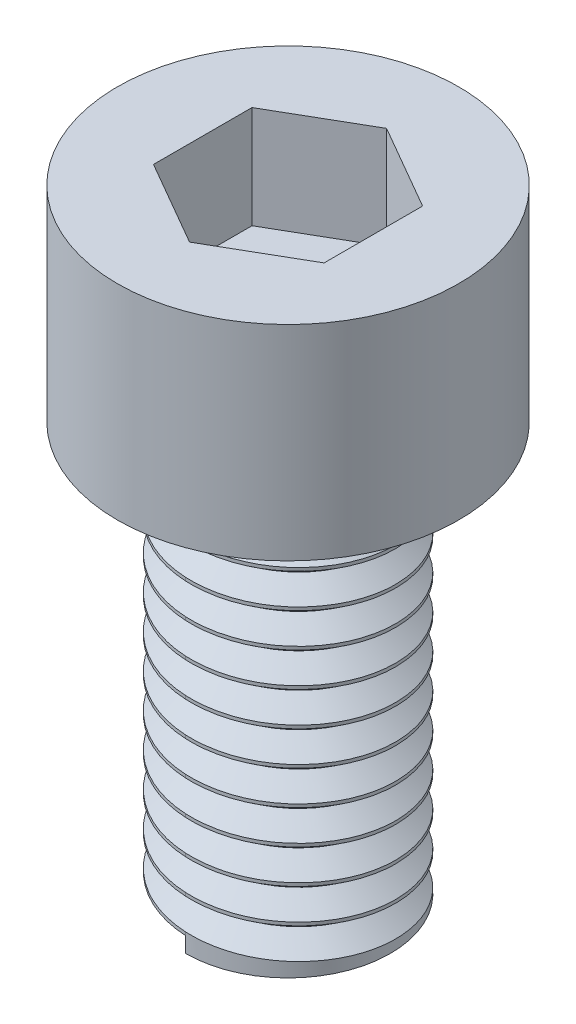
from build123d import *

# Parameters (mm, degrees)
SK_CABEZA_R         = 5
CABEZA_DEPTH        = 6
CANA_START          = -12
SK_CANA_R           = 3
CANA_DEPTH          = 12
HUECO_ALLEN_DEPTH   = 3
ROSCA_M6X1_0_PITCH  = 1
ROSCA_M6X1_0_HEIGHT = 11.4
ROSCA_M6X1_0_RADIUS = 3


with BuildPart() as part:
    # Sk_Cabeza → Cabeza (new body)
    with BuildSketch(Plane(origin=(0, 0, 0), x_dir=(1, 0, 0), z_dir=(0, 1, 0))):
        with Locations(Location((0, 0, 0), (0, 0, 270))):
            Circle(SK_CABEZA_R)
    extrude(amount=CABEZA_DEPTH)

    # Sk_Cana → Cana (add)
    with BuildSketch(Plane(origin=(0, 0, 0), x_dir=(1, 0, 0), z_dir=(0, 1, 0)).offset(CANA_START)):
        with Locations(Location((0, 0, 0), (0, 0, 270))):
            Circle(SK_CANA_R)
    extrude(amount=CANA_DEPTH)

    # Sk_Hueco_Allen → Hueco_Allen (cut)
    with BuildSketch(Plane(origin=(0, 6, 0), x_dir=(1, 0, 0), z_dir=(0, 1, 0))):
        Polygon((2.5, -1.443375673), (0, -2.886751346), (-2.5, -1.443375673), (-2.5, 1.443375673), (0, 2.886751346), (2.5, 1.443375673), align=None)
    extrude(amount=-HUECO_ALLEN_DEPTH, mode=Mode.SUBTRACT)

    # Rosca_M6x1_0: sweep along a helix
    with BuildLine() as rosca_m6x1_0_path:
        Helix(ROSCA_M6X1_0_PITCH, ROSCA_M6X1_0_HEIGHT, ROSCA_M6X1_0_RADIUS, center=(0, -12, 0), direction=(0, 1, 0), lefthand=True)
    # Sk_Perfil_rosca → Rosca_M6x1_0 (sweep, cut)
    with BuildSketch(Plane(origin=(0, 0, 0), x_dir=(0, 0, -1), z_dir=(1, 0, 0))):
        Polygon((-3.2, -12.6), (-2.3866, -12), (-3.2, -11.4), align=None)
    sweep(path=rosca_m6x1_0_path.line, is_frenet=True, mode=Mode.SUBTRACT)


solid = part.part
